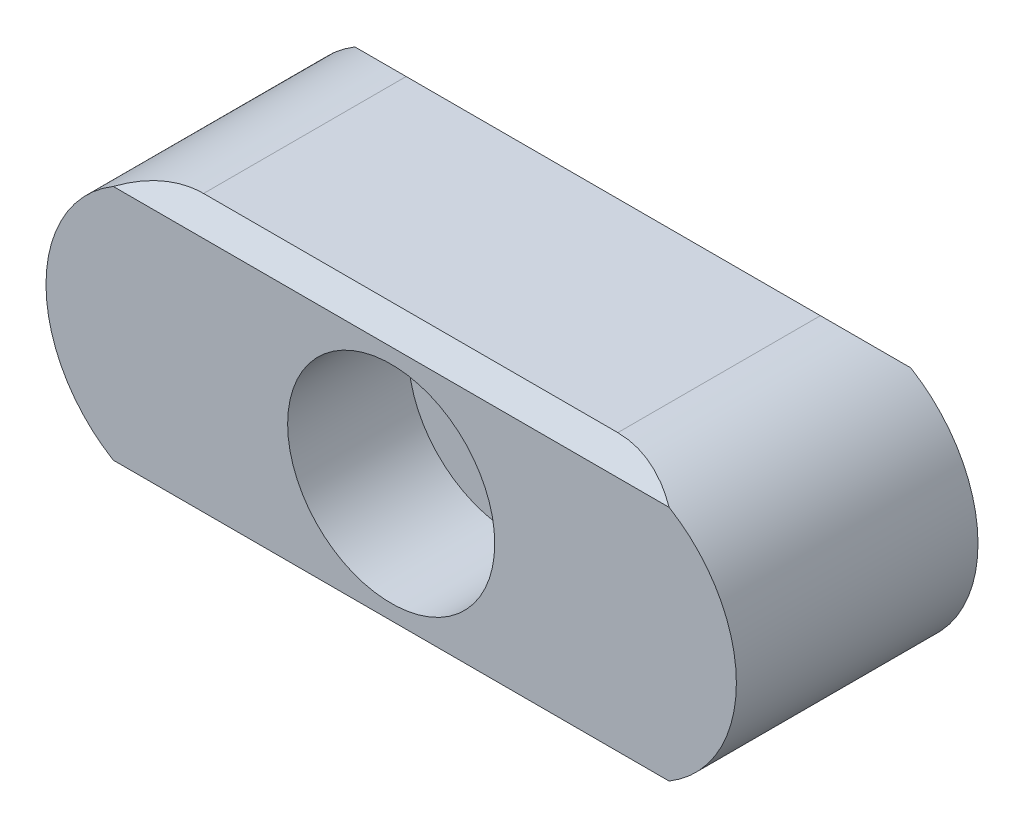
ISO-10303-21;
HEADER;
FILE_DESCRIPTION(('STEP AP214'),'2;1');
FILE_NAME('part.step','',(''),(''),'','','');
FILE_SCHEMA(('AUTOMOTIVE_DESIGN { 1 0 10303 214 1 1 1 1 }'));
ENDSEC;
DATA;
#1=APPLICATION_CONTEXT('core data for automotive mechanical design processes');
#2=APPLICATION_PROTOCOL_DEFINITION('international standard','automotive_design',2000,#1);
#3=PRODUCT_CONTEXT('',#1,'mechanical');
#4=PRODUCT('Part','Part','',(#3));
#5=PRODUCT_RELATED_PRODUCT_CATEGORY('part','',(#4));
#6=PRODUCT_DEFINITION_FORMATION('','',#4);
#7=PRODUCT_DEFINITION_CONTEXT('part definition',#1,'design');
#8=PRODUCT_DEFINITION('design','',#6,#7);
#9=PRODUCT_DEFINITION_SHAPE('','',#8);
#10=(LENGTH_UNIT() NAMED_UNIT(*) SI_UNIT(.MILLI.,.METRE.));
#11=(NAMED_UNIT(*) PLANE_ANGLE_UNIT() SI_UNIT($,.RADIAN.));
#12=(NAMED_UNIT(*) SI_UNIT($,.STERADIAN.) SOLID_ANGLE_UNIT());
#13=UNCERTAINTY_MEASURE_WITH_UNIT(LENGTH_MEASURE(1.E-05),#10,'distance_accuracy_value','');
#14=(GEOMETRIC_REPRESENTATION_CONTEXT(3) GLOBAL_UNCERTAINTY_ASSIGNED_CONTEXT((#13)) GLOBAL_UNIT_ASSIGNED_CONTEXT((#10,
#11,#12)) REPRESENTATION_CONTEXT('',''));
#15=CARTESIAN_POINT('',(0.,0.,0.));
#16=DIRECTION('',(0.,0.,1.));
#17=DIRECTION('',(1.,0.,0.));
#18=AXIS2_PLACEMENT_3D('',#15,#16,#17);
#19=CARTESIAN_POINT('',(-6.00000000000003,0.,3.5));
#20=DIRECTION('',(0.,0.,1.));
#21=DIRECTION('',(1.,0.,0.));
#22=AXIS2_PLACEMENT_3D('',#19,#20,#21);
#23=PLANE('',#22);
#24=DIRECTION('',(-1.,0.,0.));
#25=VECTOR('',#24,1.);
#26=CARTESIAN_POINT('',(-6.00000000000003,-3.4343145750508,3.5));
#27=LINE('',#26,#25);
#28=CARTESIAN_POINT('',(8.05072752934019,-3.4343145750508,3.5));
#29=VERTEX_POINT('',#28);
#30=CARTESIAN_POINT('',(-8.05072752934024,-3.4343145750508,3.5));
#31=VERTEX_POINT('',#30);
#32=EDGE_CURVE('E11',#29,#31,#27,.T.);
#33=ORIENTED_EDGE('',*,*,#32,.F.);
#34=CARTESIAN_POINT('',(6.00000000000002,0.,3.5));
#35=DIRECTION('',(0.,0.,1.));
#36=DIRECTION('',(1.,0.,0.));
#37=AXIS2_PLACEMENT_3D('',#34,#35,#36);
#38=CIRCLE('',#37,3.99999999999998);
#39=CARTESIAN_POINT('',(8.05072752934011,3.4343145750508,3.5));
#40=VERTEX_POINT('',#39);
#41=EDGE_CURVE('E164',#29,#40,#38,.T.);
#42=ORIENTED_EDGE('',*,*,#41,.T.);
#43=DIRECTION('',(1.,0.,0.));
#44=VECTOR('',#43,1.);
#45=CARTESIAN_POINT('',(-6.00000000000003,3.4343145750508,3.5));
#46=LINE('',#45,#44);
#47=CARTESIAN_POINT('',(-8.05072752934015,3.4343145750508,3.5));
#48=VERTEX_POINT('',#47);
#49=EDGE_CURVE('E51',#48,#40,#46,.T.);
#50=ORIENTED_EDGE('',*,*,#49,.F.);
#51=CARTESIAN_POINT('',(-6.00000000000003,0.,3.5));
#52=DIRECTION('',(0.,0.,1.));
#53=DIRECTION('',(1.,0.,0.));
#54=AXIS2_PLACEMENT_3D('',#51,#52,#53);
#55=CIRCLE('',#54,4.);
#56=EDGE_CURVE('E205',#48,#31,#55,.T.);
#57=ORIENTED_EDGE('',*,*,#56,.T.);
#58=EDGE_LOOP('',(#33,#42,#50,#57));
#59=FACE_BOUND('',#58,.T.);
#60=CARTESIAN_POINT('',(0.,0.,3.5));
#61=DIRECTION('',(0.,0.,1.));
#62=DIRECTION('',(1.,0.,0.));
#63=AXIS2_PLACEMENT_3D('',#60,#61,#62);
#64=CIRCLE('',#63,3.);
#65=CARTESIAN_POINT('',(3.,0.,3.5));
#66=VERTEX_POINT('',#65);
#67=EDGE_CURVE('E383',#66,#66,#64,.T.);
#68=ORIENTED_EDGE('',*,*,#67,.F.);
#69=EDGE_LOOP('',(#68));
#70=FACE_BOUND('',#69,.T.);
#71=ADVANCED_FACE('F42',(#59,#70),#23,.T.);
#72=CARTESIAN_POINT('',(-6.00000000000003,0.,-3.5));
#73=DIRECTION('',(0.,0.,1.));
#74=DIRECTION('',(1.,0.,0.));
#75=AXIS2_PLACEMENT_3D('',#72,#73,#74);
#76=PLANE('',#75);
#77=CARTESIAN_POINT('',(6.00000000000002,0.,-3.5));
#78=DIRECTION('',(0.,0.,1.));
#79=DIRECTION('',(1.,0.,0.));
#80=AXIS2_PLACEMENT_3D('',#77,#78,#79);
#81=CIRCLE('',#80,3.99999999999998);
#82=CARTESIAN_POINT('',(8.05072752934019,-3.4343145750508,-3.5));
#83=VERTEX_POINT('',#82);
#84=CARTESIAN_POINT('',(8.05072752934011,3.4343145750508,-3.5));
#85=VERTEX_POINT('',#84);
#86=EDGE_CURVE('E148',#83,#85,#81,.T.);
#87=ORIENTED_EDGE('',*,*,#86,.F.);
#88=DIRECTION('',(-1.,0.,0.));
#89=VECTOR('',#88,1.);
#90=CARTESIAN_POINT('',(-6.00000000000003,-3.4343145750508,-3.5));
#91=LINE('',#90,#89);
#92=CARTESIAN_POINT('',(-8.05072752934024,-3.4343145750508,-3.5));
#93=VERTEX_POINT('',#92);
#94=EDGE_CURVE('E174',#83,#93,#91,.T.);
#95=ORIENTED_EDGE('',*,*,#94,.T.);
#96=CARTESIAN_POINT('',(-6.00000000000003,0.,-3.5));
#97=DIRECTION('',(0.,0.,1.));
#98=DIRECTION('',(1.,0.,0.));
#99=AXIS2_PLACEMENT_3D('',#96,#97,#98);
#100=CIRCLE('',#99,4.);
#101=CARTESIAN_POINT('',(-8.05072752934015,3.4343145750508,-3.5));
#102=VERTEX_POINT('',#101);
#103=EDGE_CURVE('E200',#102,#93,#100,.T.);
#104=ORIENTED_EDGE('',*,*,#103,.F.);
#105=DIRECTION('',(1.,0.,0.));
#106=VECTOR('',#105,1.);
#107=CARTESIAN_POINT('',(-6.00000000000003,3.4343145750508,-3.5));
#108=LINE('',#107,#106);
#109=EDGE_CURVE('E171',#102,#85,#108,.T.);
#110=ORIENTED_EDGE('',*,*,#109,.T.);
#111=EDGE_LOOP('',(#87,#95,#104,#110));
#112=FACE_BOUND('',#111,.T.);
#113=CARTESIAN_POINT('',(0.,0.,-3.5));
#114=DIRECTION('',(0.,0.,1.));
#115=DIRECTION('',(1.,0.,0.));
#116=AXIS2_PLACEMENT_3D('',#113,#114,#115);
#117=CIRCLE('',#116,1.7);
#118=CARTESIAN_POINT('',(1.7,0.,-3.5));
#119=VERTEX_POINT('',#118);
#120=EDGE_CURVE('E379',#119,#119,#117,.T.);
#121=ORIENTED_EDGE('',*,*,#120,.T.);
#122=EDGE_LOOP('',(#121));
#123=FACE_BOUND('',#122,.T.);
#124=ADVANCED_FACE('F226',(#112,#123),#76,.F.);
#125=CARTESIAN_POINT('',(-6.00000000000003,0.,3.5));
#126=DIRECTION('',(0.,0.,-1.));
#127=DIRECTION('',(-1.,0.,0.));
#128=AXIS2_PLACEMENT_3D('',#125,#126,#127);
#129=CYLINDRICAL_SURFACE('',#128,3.99999999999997);
#130=DIRECTION('',(0.,0.,-1.));
#131=VECTOR('',#130,1.);
#132=CARTESIAN_POINT('',(-6.,-4.,3.5));
#133=LINE('',#132,#131);
#134=CARTESIAN_POINT('',(-6.,-4.,2.9343145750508));
#135=VERTEX_POINT('',#134);
#136=CARTESIAN_POINT('',(-6.,-4.,-2.9343145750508));
#137=VERTEX_POINT('',#136);
#138=EDGE_CURVE('E161',#135,#137,#133,.T.);
#139=ORIENTED_EDGE('',*,*,#138,.F.);
#140=CARTESIAN_POINT('',(-6.00000000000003,0.,6.93431457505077));
#141=DIRECTION('',(0.,0.707106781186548,-0.707106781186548));
#142=DIRECTION('',(0.,-0.707106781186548,-0.707106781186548));
#143=AXIS2_PLACEMENT_3D('',#140,#141,#142);
#144=ELLIPSE('',#143,5.65685424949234,3.99999999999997);
#145=EDGE_CURVE('E196',#135,#31,#144,.T.);
#146=ORIENTED_EDGE('',*,*,#145,.T.);
#147=ORIENTED_EDGE('',*,*,#56,.F.);
#148=CARTESIAN_POINT('',(-6.00000000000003,0.,6.93431457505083));
#149=DIRECTION('',(0.,-0.707106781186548,-0.707106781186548));
#150=DIRECTION('',(0.,0.707106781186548,-0.707106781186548));
#151=AXIS2_PLACEMENT_3D('',#148,#149,#150);
#152=ELLIPSE('',#151,5.65685424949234,3.99999999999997);
#153=CARTESIAN_POINT('',(-6.,4.,2.9343145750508));
#154=VERTEX_POINT('',#153);
#155=EDGE_CURVE('E71',#48,#154,#152,.T.);
#156=ORIENTED_EDGE('',*,*,#155,.T.);
#157=DIRECTION('',(0.,0.,-1.));
#158=VECTOR('',#157,1.);
#159=CARTESIAN_POINT('',(-6.,4.,3.5));
#160=LINE('',#159,#158);
#161=CARTESIAN_POINT('',(-6.,4.,-2.9343145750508));
#162=VERTEX_POINT('',#161);
#163=EDGE_CURVE('E156',#154,#162,#160,.T.);
#164=ORIENTED_EDGE('',*,*,#163,.T.);
#165=CARTESIAN_POINT('',(-6.00000000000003,0.,-6.93431457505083));
#166=DIRECTION('',(0.,-0.707106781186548,0.707106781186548));
#167=DIRECTION('',(0.,-0.707106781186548,-0.707106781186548));
#168=AXIS2_PLACEMENT_3D('',#165,#166,#167);
#169=ELLIPSE('',#168,5.65685424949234,3.99999999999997);
#170=EDGE_CURVE('E131',#162,#102,#169,.T.);
#171=ORIENTED_EDGE('',*,*,#170,.T.);
#172=ORIENTED_EDGE('',*,*,#103,.T.);
#173=CARTESIAN_POINT('',(-6.00000000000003,0.,-6.93431457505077));
#174=DIRECTION('',(0.,0.707106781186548,0.707106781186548));
#175=DIRECTION('',(0.,0.707106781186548,-0.707106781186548));
#176=AXIS2_PLACEMENT_3D('',#173,#174,#175);
#177=ELLIPSE('',#176,5.65685424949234,3.99999999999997);
#178=EDGE_CURVE('E184',#93,#137,#177,.T.);
#179=ORIENTED_EDGE('',*,*,#178,.T.);
#180=EDGE_LOOP('',(#139,#146,#147,#156,#164,#171,#172,#179));
#181=FACE_BOUND('',#180,.T.);
#182=ADVANCED_FACE('F44',(#181),#129,.T.);
#183=CARTESIAN_POINT('',(-6.,-4.,3.5));
#184=DIRECTION('',(0.,1.,0.));
#185=DIRECTION('',(0.,0.,1.));
#186=AXIS2_PLACEMENT_3D('',#183,#184,#185);
#187=PLANE('',#186);
#188=DIRECTION('',(0.,0.,-1.));
#189=VECTOR('',#188,1.);
#190=CARTESIAN_POINT('',(6.,-4.,3.5));
#191=LINE('',#190,#189);
#192=CARTESIAN_POINT('',(6.00000000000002,-4.,2.9343145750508));
#193=VERTEX_POINT('',#192);
#194=CARTESIAN_POINT('',(6.00000000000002,-4.00000000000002,-2.93431457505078));
#195=VERTEX_POINT('',#194);
#196=EDGE_CURVE('E155',#193,#195,#191,.T.);
#197=ORIENTED_EDGE('',*,*,#196,.F.);
#198=DIRECTION('',(-1.,0.,0.));
#199=VECTOR('',#198,1.);
#200=CARTESIAN_POINT('',(10.,-4.,2.9343145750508));
#201=LINE('',#200,#199);
#202=EDGE_CURVE('E150',#193,#135,#201,.T.);
#203=ORIENTED_EDGE('',*,*,#202,.T.);
#204=ORIENTED_EDGE('',*,*,#138,.T.);
#205=DIRECTION('',(-1.,0.,0.));
#206=VECTOR('',#205,1.);
#207=CARTESIAN_POINT('',(10.,-4.,-2.9343145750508));
#208=LINE('',#207,#206);
#209=EDGE_CURVE('E137',#195,#137,#208,.T.);
#210=ORIENTED_EDGE('',*,*,#209,.F.);
#211=EDGE_LOOP('',(#197,#203,#204,#210));
#212=FACE_BOUND('',#211,.T.);
#213=ADVANCED_FACE('F216',(#212),#187,.F.);
#214=CARTESIAN_POINT('',(6.00000000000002,0.,3.5));
#215=DIRECTION('',(0.,0.,-1.));
#216=DIRECTION('',(-1.,0.,0.));
#217=AXIS2_PLACEMENT_3D('',#214,#215,#216);
#218=CYLINDRICAL_SURFACE('',#217,4.);
#219=ORIENTED_EDGE('',*,*,#41,.F.);
#220=CARTESIAN_POINT('',(6.00000000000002,0.,6.93431457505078));
#221=DIRECTION('',(0.,0.707106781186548,-0.707106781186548));
#222=DIRECTION('',(0.,-0.707106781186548,-0.707106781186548));
#223=AXIS2_PLACEMENT_3D('',#220,#221,#222);
#224=ELLIPSE('',#223,5.65685424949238,4.);
#225=EDGE_CURVE('E60',#29,#193,#224,.T.);
#226=ORIENTED_EDGE('',*,*,#225,.T.);
#227=ORIENTED_EDGE('',*,*,#196,.T.);
#228=CARTESIAN_POINT('',(6.00000000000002,0.,-6.93431457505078));
#229=DIRECTION('',(0.,0.707106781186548,0.707106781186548));
#230=DIRECTION('',(0.,0.707106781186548,-0.707106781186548));
#231=AXIS2_PLACEMENT_3D('',#228,#229,#230);
#232=ELLIPSE('',#231,5.65685424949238,4.);
#233=EDGE_CURVE('E190',#195,#83,#232,.T.);
#234=ORIENTED_EDGE('',*,*,#233,.T.);
#235=ORIENTED_EDGE('',*,*,#86,.T.);
#236=CARTESIAN_POINT('',(6.00000000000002,0.,-6.93431457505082));
#237=DIRECTION('',(0.,-0.707106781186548,0.707106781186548));
#238=DIRECTION('',(0.,-0.707106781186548,-0.707106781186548));
#239=AXIS2_PLACEMENT_3D('',#236,#237,#238);
#240=ELLIPSE('',#239,5.65685424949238,4.);
#241=CARTESIAN_POINT('',(6.,4.,-2.9343145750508));
#242=VERTEX_POINT('',#241);
#243=EDGE_CURVE('E128',#85,#242,#240,.T.);
#244=ORIENTED_EDGE('',*,*,#243,.T.);
#245=DIRECTION('',(0.,0.,-1.));
#246=VECTOR('',#245,1.);
#247=CARTESIAN_POINT('',(6.,3.99999999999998,3.5));
#248=LINE('',#247,#246);
#249=CARTESIAN_POINT('',(6.,4.,2.9343145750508));
#250=VERTEX_POINT('',#249);
#251=EDGE_CURVE('E145',#250,#242,#248,.T.);
#252=ORIENTED_EDGE('',*,*,#251,.F.);
#253=CARTESIAN_POINT('',(6.00000000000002,0.,6.93431457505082));
#254=DIRECTION('',(0.,-0.707106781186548,-0.707106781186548));
#255=DIRECTION('',(0.,0.707106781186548,-0.707106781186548));
#256=AXIS2_PLACEMENT_3D('',#253,#254,#255);
#257=ELLIPSE('',#256,5.65685424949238,4.);
#258=EDGE_CURVE('E181',#250,#40,#257,.T.);
#259=ORIENTED_EDGE('',*,*,#258,.T.);
#260=EDGE_LOOP('',(#219,#226,#227,#234,#235,#244,#252,#259));
#261=FACE_BOUND('',#260,.T.);
#262=ADVANCED_FACE('F143',(#261),#218,.T.);
#263=CARTESIAN_POINT('',(6.,4.,3.5));
#264=DIRECTION('',(0.,-1.,0.));
#265=DIRECTION('',(0.,0.,-1.));
#266=AXIS2_PLACEMENT_3D('',#263,#264,#265);
#267=PLANE('',#266);
#268=ORIENTED_EDGE('',*,*,#251,.T.);
#269=DIRECTION('',(-1.,0.,0.));
#270=VECTOR('',#269,1.);
#271=CARTESIAN_POINT('',(10.,4.,-2.9343145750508));
#272=LINE('',#271,#270);
#273=EDGE_CURVE('E125',#242,#162,#272,.T.);
#274=ORIENTED_EDGE('',*,*,#273,.T.);
#275=ORIENTED_EDGE('',*,*,#163,.F.);
#276=DIRECTION('',(-1.,0.,0.));
#277=VECTOR('',#276,1.);
#278=CARTESIAN_POINT('',(10.,4.,2.9343145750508));
#279=LINE('',#278,#277);
#280=EDGE_CURVE('E138',#250,#154,#279,.T.);
#281=ORIENTED_EDGE('',*,*,#280,.F.);
#282=EDGE_LOOP('',(#268,#274,#275,#281));
#283=FACE_BOUND('',#282,.T.);
#284=ADVANCED_FACE('F153',(#283),#267,.F.);
#285=CARTESIAN_POINT('',(10.,3.4343145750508,-3.5));
#286=DIRECTION('',(0.,-0.707106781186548,0.707106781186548));
#287=DIRECTION('',(0.,-0.707106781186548,-0.707106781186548));
#288=AXIS2_PLACEMENT_3D('',#285,#286,#287);
#289=PLANE('',#288);
#290=ORIENTED_EDGE('',*,*,#273,.F.);
#291=ORIENTED_EDGE('',*,*,#243,.F.);
#292=ORIENTED_EDGE('',*,*,#109,.F.);
#293=ORIENTED_EDGE('',*,*,#170,.F.);
#294=EDGE_LOOP('',(#290,#291,#292,#293));
#295=FACE_BOUND('',#294,.T.);
#296=ADVANCED_FACE('F127',(#295),#289,.F.);
#297=CARTESIAN_POINT('',(10.,-4.,-2.9343145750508));
#298=DIRECTION('',(0.,0.707106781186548,0.707106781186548));
#299=DIRECTION('',(0.,-0.707106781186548,0.707106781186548));
#300=AXIS2_PLACEMENT_3D('',#297,#298,#299);
#301=PLANE('',#300);
#302=ORIENTED_EDGE('',*,*,#94,.F.);
#303=ORIENTED_EDGE('',*,*,#233,.F.);
#304=ORIENTED_EDGE('',*,*,#209,.T.);
#305=ORIENTED_EDGE('',*,*,#178,.F.);
#306=EDGE_LOOP('',(#302,#303,#304,#305));
#307=FACE_BOUND('',#306,.T.);
#308=ADVANCED_FACE('F229',(#307),#301,.F.);
#309=CARTESIAN_POINT('',(10.,4.,2.9343145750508));
#310=DIRECTION('',(0.,-0.707106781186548,-0.707106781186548));
#311=DIRECTION('',(0.,0.707106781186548,-0.707106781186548));
#312=AXIS2_PLACEMENT_3D('',#309,#310,#311);
#313=PLANE('',#312);
#314=ORIENTED_EDGE('',*,*,#49,.T.);
#315=ORIENTED_EDGE('',*,*,#258,.F.);
#316=ORIENTED_EDGE('',*,*,#280,.T.);
#317=ORIENTED_EDGE('',*,*,#155,.F.);
#318=EDGE_LOOP('',(#314,#315,#316,#317));
#319=FACE_BOUND('',#318,.T.);
#320=ADVANCED_FACE('F180',(#319),#313,.F.);
#321=CARTESIAN_POINT('',(10.,-3.4343145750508,3.5));
#322=DIRECTION('',(0.,0.707106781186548,-0.707106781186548));
#323=DIRECTION('',(0.,0.707106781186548,0.707106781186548));
#324=AXIS2_PLACEMENT_3D('',#321,#322,#323);
#325=PLANE('',#324);
#326=ORIENTED_EDGE('',*,*,#202,.F.);
#327=ORIENTED_EDGE('',*,*,#225,.F.);
#328=ORIENTED_EDGE('',*,*,#32,.T.);
#329=ORIENTED_EDGE('',*,*,#145,.F.);
#330=EDGE_LOOP('',(#326,#327,#328,#329));
#331=FACE_BOUND('',#330,.T.);
#332=ADVANCED_FACE('F208',(#331),#325,.F.);
#333=CARTESIAN_POINT('',(0.,0.,-3.5));
#334=DIRECTION('',(0.,0.,1.));
#335=DIRECTION('',(1.,0.,0.));
#336=AXIS2_PLACEMENT_3D('',#333,#334,#335);
#337=CYLINDRICAL_SURFACE('',#336,3.);
#338=ORIENTED_EDGE('',*,*,#67,.T.);
#339=EDGE_LOOP('',(#338));
#340=FACE_BOUND('',#339,.T.);
#341=CARTESIAN_POINT('',(0.,0.,0.));
#342=DIRECTION('',(0.,0.,1.));
#343=DIRECTION('',(1.,0.,0.));
#344=AXIS2_PLACEMENT_3D('',#341,#342,#343);
#345=CIRCLE('',#344,3.);
#346=CARTESIAN_POINT('',(3.,0.,0.));
#347=VERTEX_POINT('',#346);
#348=EDGE_CURVE('E374',#347,#347,#345,.T.);
#349=ORIENTED_EDGE('',*,*,#348,.F.);
#350=EDGE_LOOP('',(#349));
#351=FACE_BOUND('',#350,.T.);
#352=ADVANCED_FACE('F288',(#340,#351),#337,.F.);
#353=CARTESIAN_POINT('',(0.,3.,0.));
#354=DIRECTION('',(0.,0.,1.));
#355=DIRECTION('',(1.,0.,0.));
#356=AXIS2_PLACEMENT_3D('',#353,#354,#355);
#357=PLANE('',#356);
#358=ORIENTED_EDGE('',*,*,#348,.T.);
#359=EDGE_LOOP('',(#358));
#360=FACE_BOUND('',#359,.T.);
#361=CARTESIAN_POINT('',(0.,0.,0.));
#362=DIRECTION('',(0.,0.,1.));
#363=DIRECTION('',(1.,0.,0.));
#364=AXIS2_PLACEMENT_3D('',#361,#362,#363);
#365=CIRCLE('',#364,1.7);
#366=CARTESIAN_POINT('',(1.7,0.,0.));
#367=VERTEX_POINT('',#366);
#368=EDGE_CURVE('E377',#367,#367,#365,.T.);
#369=ORIENTED_EDGE('',*,*,#368,.F.);
#370=EDGE_LOOP('',(#369));
#371=FACE_BOUND('',#370,.T.);
#372=ADVANCED_FACE('F274',(#360,#371),#357,.T.);
#373=CARTESIAN_POINT('',(0.,0.,-3.5));
#374=DIRECTION('',(0.,0.,1.));
#375=DIRECTION('',(1.,0.,0.));
#376=AXIS2_PLACEMENT_3D('',#373,#374,#375);
#377=CYLINDRICAL_SURFACE('',#376,1.7);
#378=ORIENTED_EDGE('',*,*,#368,.T.);
#379=EDGE_LOOP('',(#378));
#380=FACE_BOUND('',#379,.T.);
#381=ORIENTED_EDGE('',*,*,#120,.F.);
#382=EDGE_LOOP('',(#381));
#383=FACE_BOUND('',#382,.T.);
#384=ADVANCED_FACE('F270',(#380,#383),#377,.F.);
#385=CLOSED_SHELL('',(#71,#124,#182,#213,#262,#284,#296,#308,#320,#332,#352,#372,#384));
#386=MANIFOLD_SOLID_BREP('B2',#385);
#387=ADVANCED_BREP_SHAPE_REPRESENTATION('',(#18,#386),#14);
#388=SHAPE_DEFINITION_REPRESENTATION(#9,#387);
ENDSEC;
END-ISO-10303-21;
